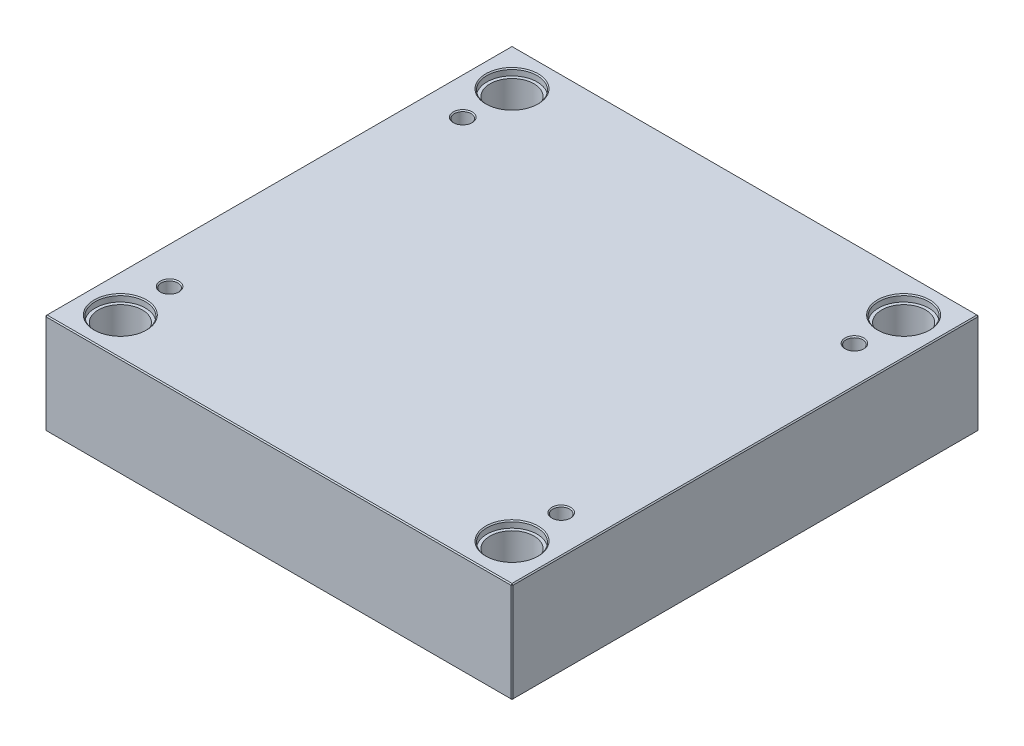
ISO-10303-21;
HEADER;
FILE_DESCRIPTION(('STEP AP214'),'2;1');
FILE_NAME('part.step','',(''),(''),'','','');
FILE_SCHEMA(('AUTOMOTIVE_DESIGN { 1 0 10303 214 1 1 1 1 }'));
ENDSEC;
DATA;
#1=APPLICATION_CONTEXT('core data for automotive mechanical design processes');
#2=APPLICATION_PROTOCOL_DEFINITION('international standard','automotive_design',2000,#1);
#3=PRODUCT_CONTEXT('',#1,'mechanical');
#4=PRODUCT('Part','Part','',(#3));
#5=PRODUCT_RELATED_PRODUCT_CATEGORY('part','',(#4));
#6=PRODUCT_DEFINITION_FORMATION('','',#4);
#7=PRODUCT_DEFINITION_CONTEXT('part definition',#1,'design');
#8=PRODUCT_DEFINITION('design','',#6,#7);
#9=PRODUCT_DEFINITION_SHAPE('','',#8);
#10=(LENGTH_UNIT() NAMED_UNIT(*) SI_UNIT(.MILLI.,.METRE.));
#11=(NAMED_UNIT(*) PLANE_ANGLE_UNIT() SI_UNIT($,.RADIAN.));
#12=(NAMED_UNIT(*) SI_UNIT($,.STERADIAN.) SOLID_ANGLE_UNIT());
#13=UNCERTAINTY_MEASURE_WITH_UNIT(LENGTH_MEASURE(1.E-05),#10,'distance_accuracy_value','');
#14=(GEOMETRIC_REPRESENTATION_CONTEXT(3) GLOBAL_UNCERTAINTY_ASSIGNED_CONTEXT((#13)) GLOBAL_UNIT_ASSIGNED_CONTEXT((#10,
#11,#12)) REPRESENTATION_CONTEXT('',''));
#15=CARTESIAN_POINT('',(0.,0.,0.));
#16=DIRECTION('',(0.,0.,1.));
#17=DIRECTION('',(1.,0.,0.));
#18=AXIS2_PLACEMENT_3D('',#15,#16,#17);
#19=CARTESIAN_POINT('',(-187.,0.,-187.));
#20=DIRECTION('',(0.,1.,0.));
#21=DIRECTION('',(0.,0.,1.));
#22=AXIS2_PLACEMENT_3D('',#19,#20,#21);
#23=CYLINDRICAL_SURFACE('',#22,21.);
#24=CARTESIAN_POINT('',(-187.,1.00000000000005,-187.));
#25=DIRECTION('',(0.,1.,0.));
#26=DIRECTION('',(0.,0.,1.));
#27=AXIS2_PLACEMENT_3D('',#24,#25,#26);
#28=CIRCLE('',#27,21.);
#29=CARTESIAN_POINT('',(-187.,1.00000000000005,-166.));
#30=VERTEX_POINT('',#29);
#31=EDGE_CURVE('E472',#30,#30,#28,.F.);
#32=ORIENTED_EDGE('',*,*,#31,.T.);
#33=EDGE_LOOP('',(#32));
#34=FACE_BOUND('',#33,.T.);
#35=CARTESIAN_POINT('',(-187.,89.7,-187.));
#36=DIRECTION('',(0.,1.,0.));
#37=DIRECTION('',(0.,0.,1.));
#38=AXIS2_PLACEMENT_3D('',#35,#36,#37);
#39=CIRCLE('',#38,21.);
#40=CARTESIAN_POINT('',(-187.,89.7,-166.));
#41=VERTEX_POINT('',#40);
#42=EDGE_CURVE('E221',#41,#41,#39,.F.);
#43=ORIENTED_EDGE('',*,*,#42,.F.);
#44=EDGE_LOOP('',(#43));
#45=FACE_BOUND('',#44,.T.);
#46=ADVANCED_FACE('F16',(#34,#45),#23,.F.);
#47=CARTESIAN_POINT('',(187.,0.,-187.));
#48=DIRECTION('',(0.,1.,0.));
#49=DIRECTION('',(0.,0.,1.));
#50=AXIS2_PLACEMENT_3D('',#47,#48,#49);
#51=CYLINDRICAL_SURFACE('',#50,21.);
#52=CARTESIAN_POINT('',(187.,1.00000000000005,-187.));
#53=DIRECTION('',(0.,1.,0.));
#54=DIRECTION('',(0.,0.,1.));
#55=AXIS2_PLACEMENT_3D('',#52,#53,#54);
#56=CIRCLE('',#55,21.);
#57=CARTESIAN_POINT('',(187.,1.00000000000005,-166.));
#58=VERTEX_POINT('',#57);
#59=EDGE_CURVE('E474',#58,#58,#56,.F.);
#60=ORIENTED_EDGE('',*,*,#59,.T.);
#61=EDGE_LOOP('',(#60));
#62=FACE_BOUND('',#61,.T.);
#63=CARTESIAN_POINT('',(187.,89.7,-187.));
#64=DIRECTION('',(0.,1.,0.));
#65=DIRECTION('',(0.,0.,1.));
#66=AXIS2_PLACEMENT_3D('',#63,#64,#65);
#67=CIRCLE('',#66,21.);
#68=CARTESIAN_POINT('',(187.,89.7,-166.));
#69=VERTEX_POINT('',#68);
#70=EDGE_CURVE('E218',#69,#69,#67,.F.);
#71=ORIENTED_EDGE('',*,*,#70,.F.);
#72=EDGE_LOOP('',(#71));
#73=FACE_BOUND('',#72,.T.);
#74=ADVANCED_FACE('F263',(#62,#73),#51,.F.);
#75=CARTESIAN_POINT('',(187.,0.,187.));
#76=DIRECTION('',(0.,1.,0.));
#77=DIRECTION('',(0.,0.,1.));
#78=AXIS2_PLACEMENT_3D('',#75,#76,#77);
#79=CYLINDRICAL_SURFACE('',#78,21.);
#80=CARTESIAN_POINT('',(187.,0.999999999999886,187.));
#81=DIRECTION('',(0.,1.,0.));
#82=DIRECTION('',(0.,0.,1.));
#83=AXIS2_PLACEMENT_3D('',#80,#81,#82);
#84=CIRCLE('',#83,21.);
#85=CARTESIAN_POINT('',(187.,0.999999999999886,208.));
#86=VERTEX_POINT('',#85);
#87=EDGE_CURVE('E477',#86,#86,#84,.F.);
#88=ORIENTED_EDGE('',*,*,#87,.T.);
#89=EDGE_LOOP('',(#88));
#90=FACE_BOUND('',#89,.T.);
#91=CARTESIAN_POINT('',(187.,89.7,187.));
#92=DIRECTION('',(0.,1.,0.));
#93=DIRECTION('',(0.,0.,1.));
#94=AXIS2_PLACEMENT_3D('',#91,#92,#93);
#95=CIRCLE('',#94,21.);
#96=CARTESIAN_POINT('',(187.,89.7,208.));
#97=VERTEX_POINT('',#96);
#98=EDGE_CURVE('E214',#97,#97,#95,.F.);
#99=ORIENTED_EDGE('',*,*,#98,.F.);
#100=EDGE_LOOP('',(#99));
#101=FACE_BOUND('',#100,.T.);
#102=ADVANCED_FACE('F270',(#90,#101),#79,.F.);
#103=CARTESIAN_POINT('',(-187.,0.,187.));
#104=DIRECTION('',(0.,1.,0.));
#105=DIRECTION('',(0.,0.,1.));
#106=AXIS2_PLACEMENT_3D('',#103,#104,#105);
#107=CYLINDRICAL_SURFACE('',#106,21.);
#108=CARTESIAN_POINT('',(-187.,0.999999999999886,187.));
#109=DIRECTION('',(0.,1.,0.));
#110=DIRECTION('',(0.,0.,1.));
#111=AXIS2_PLACEMENT_3D('',#108,#109,#110);
#112=CIRCLE('',#111,21.);
#113=CARTESIAN_POINT('',(-187.,0.999999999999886,208.));
#114=VERTEX_POINT('',#113);
#115=EDGE_CURVE('E480',#114,#114,#112,.F.);
#116=ORIENTED_EDGE('',*,*,#115,.T.);
#117=EDGE_LOOP('',(#116));
#118=FACE_BOUND('',#117,.T.);
#119=CARTESIAN_POINT('',(-187.,89.7,187.));
#120=DIRECTION('',(0.,1.,0.));
#121=DIRECTION('',(0.,0.,1.));
#122=AXIS2_PLACEMENT_3D('',#119,#120,#121);
#123=CIRCLE('',#122,21.);
#124=CARTESIAN_POINT('',(-187.,89.7,208.));
#125=VERTEX_POINT('',#124);
#126=EDGE_CURVE('E211',#125,#125,#123,.F.);
#127=ORIENTED_EDGE('',*,*,#126,.F.);
#128=EDGE_LOOP('',(#127));
#129=FACE_BOUND('',#128,.T.);
#130=ADVANCED_FACE('F277',(#118,#129),#107,.F.);
#131=CARTESIAN_POINT('',(-223.,96.,223.));
#132=DIRECTION('',(1.,0.,0.));
#133=DIRECTION('',(0.,0.,-1.));
#134=AXIS2_PLACEMENT_3D('',#131,#132,#133);
#135=PLANE('',#134);
#136=DIRECTION('',(0.,-1.,0.));
#137=VECTOR('',#136,1.);
#138=CARTESIAN_POINT('',(-223.,96.,-222.));
#139=LINE('',#138,#137);
#140=CARTESIAN_POINT('',(-223.,95.,-222.));
#141=VERTEX_POINT('',#140);
#142=CARTESIAN_POINT('',(-223.,1.,-222.));
#143=VERTEX_POINT('',#142);
#144=EDGE_CURVE('E487',#141,#143,#139,.T.);
#145=ORIENTED_EDGE('',*,*,#144,.T.);
#146=DIRECTION('',(0.,0.,1.));
#147=VECTOR('',#146,1.);
#148=CARTESIAN_POINT('',(-223.,1.,223.));
#149=LINE('',#148,#147);
#150=CARTESIAN_POINT('',(-223.,1.,222.));
#151=VERTEX_POINT('',#150);
#152=EDGE_CURVE('E490',#143,#151,#149,.T.);
#153=ORIENTED_EDGE('',*,*,#152,.T.);
#154=DIRECTION('',(0.,1.,0.));
#155=VECTOR('',#154,1.);
#156=CARTESIAN_POINT('',(-223.,96.,222.));
#157=LINE('',#156,#155);
#158=CARTESIAN_POINT('',(-223.,95.,222.));
#159=VERTEX_POINT('',#158);
#160=EDGE_CURVE('E485',#151,#159,#157,.T.);
#161=ORIENTED_EDGE('',*,*,#160,.T.);
#162=DIRECTION('',(0.,0.,-1.));
#163=VECTOR('',#162,1.);
#164=CARTESIAN_POINT('',(-223.,95.,-223.));
#165=LINE('',#164,#163);
#166=EDGE_CURVE('E483',#159,#141,#165,.T.);
#167=ORIENTED_EDGE('',*,*,#166,.T.);
#168=EDGE_LOOP('',(#145,#153,#161,#167));
#169=FACE_BOUND('',#168,.T.);
#170=ADVANCED_FACE('F298',(#169),#135,.F.);
#171=CARTESIAN_POINT('',(223.,96.,223.));
#172=DIRECTION('',(0.,0.,-1.));
#173=DIRECTION('',(-1.,0.,0.));
#174=AXIS2_PLACEMENT_3D('',#171,#172,#173);
#175=PLANE('',#174);
#176=DIRECTION('',(-1.,0.,0.));
#177=VECTOR('',#176,1.);
#178=CARTESIAN_POINT('',(-223.,95.,223.));
#179=LINE('',#178,#177);
#180=CARTESIAN_POINT('',(222.,95.,223.));
#181=VERTEX_POINT('',#180);
#182=CARTESIAN_POINT('',(-222.,95.,223.));
#183=VERTEX_POINT('',#182);
#184=EDGE_CURVE('E509',#181,#183,#179,.T.);
#185=ORIENTED_EDGE('',*,*,#184,.T.);
#186=DIRECTION('',(0.,-1.,0.));
#187=VECTOR('',#186,1.);
#188=CARTESIAN_POINT('',(-222.,96.,223.));
#189=LINE('',#188,#187);
#190=CARTESIAN_POINT('',(-222.,1.00000000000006,223.));
#191=VERTEX_POINT('',#190);
#192=EDGE_CURVE('E515',#183,#191,#189,.T.);
#193=ORIENTED_EDGE('',*,*,#192,.T.);
#194=DIRECTION('',(1.,0.,0.));
#195=VECTOR('',#194,1.);
#196=CARTESIAN_POINT('',(223.,1.00000000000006,223.));
#197=LINE('',#196,#195);
#198=CARTESIAN_POINT('',(222.,1.00000000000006,223.));
#199=VERTEX_POINT('',#198);
#200=EDGE_CURVE('E513',#191,#199,#197,.T.);
#201=ORIENTED_EDGE('',*,*,#200,.T.);
#202=DIRECTION('',(0.,1.,0.));
#203=VECTOR('',#202,1.);
#204=CARTESIAN_POINT('',(222.,96.,223.));
#205=LINE('',#204,#203);
#206=EDGE_CURVE('E511',#199,#181,#205,.T.);
#207=ORIENTED_EDGE('',*,*,#206,.T.);
#208=EDGE_LOOP('',(#185,#193,#201,#207));
#209=FACE_BOUND('',#208,.T.);
#210=ADVANCED_FACE('F294',(#209),#175,.F.);
#211=CARTESIAN_POINT('',(223.,96.,223.));
#212=DIRECTION('',(-1.,0.,0.));
#213=DIRECTION('',(0.,0.,1.));
#214=AXIS2_PLACEMENT_3D('',#211,#212,#213);
#215=PLANE('',#214);
#216=DIRECTION('',(0.,0.,-1.));
#217=VECTOR('',#216,1.);
#218=CARTESIAN_POINT('',(223.,1.00000000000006,223.));
#219=LINE('',#218,#217);
#220=CARTESIAN_POINT('',(223.,1.00000000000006,222.));
#221=VERTEX_POINT('',#220);
#222=CARTESIAN_POINT('',(223.,1.00000000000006,-222.));
#223=VERTEX_POINT('',#222);
#224=EDGE_CURVE('E504',#221,#223,#219,.T.);
#225=ORIENTED_EDGE('',*,*,#224,.T.);
#226=DIRECTION('',(0.,1.,0.));
#227=VECTOR('',#226,1.);
#228=CARTESIAN_POINT('',(223.,96.,-222.));
#229=LINE('',#228,#227);
#230=CARTESIAN_POINT('',(223.,95.,-222.));
#231=VERTEX_POINT('',#230);
#232=EDGE_CURVE('E506',#223,#231,#229,.T.);
#233=ORIENTED_EDGE('',*,*,#232,.T.);
#234=DIRECTION('',(0.,0.,1.));
#235=VECTOR('',#234,1.);
#236=CARTESIAN_POINT('',(223.,95.,223.));
#237=LINE('',#236,#235);
#238=CARTESIAN_POINT('',(223.,95.,222.));
#239=VERTEX_POINT('',#238);
#240=EDGE_CURVE('E500',#231,#239,#237,.T.);
#241=ORIENTED_EDGE('',*,*,#240,.T.);
#242=DIRECTION('',(0.,-1.,0.));
#243=VECTOR('',#242,1.);
#244=CARTESIAN_POINT('',(223.,96.,222.));
#245=LINE('',#244,#243);
#246=EDGE_CURVE('E502',#239,#221,#245,.T.);
#247=ORIENTED_EDGE('',*,*,#246,.T.);
#248=EDGE_LOOP('',(#225,#233,#241,#247));
#249=FACE_BOUND('',#248,.T.);
#250=ADVANCED_FACE('F290',(#249),#215,.F.);
#251=CARTESIAN_POINT('',(223.,96.,-223.));
#252=DIRECTION('',(0.,0.,1.));
#253=DIRECTION('',(1.,0.,0.));
#254=AXIS2_PLACEMENT_3D('',#251,#252,#253);
#255=PLANE('',#254);
#256=DIRECTION('',(0.,-1.,0.));
#257=VECTOR('',#256,1.);
#258=CARTESIAN_POINT('',(222.,96.,-223.));
#259=LINE('',#258,#257);
#260=CARTESIAN_POINT('',(222.,95.,-223.));
#261=VERTEX_POINT('',#260);
#262=CARTESIAN_POINT('',(222.,1.00000000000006,-223.));
#263=VERTEX_POINT('',#262);
#264=EDGE_CURVE('E494',#261,#263,#259,.T.);
#265=ORIENTED_EDGE('',*,*,#264,.T.);
#266=DIRECTION('',(-1.,0.,0.));
#267=VECTOR('',#266,1.);
#268=CARTESIAN_POINT('',(223.,1.00000000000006,-223.));
#269=LINE('',#268,#267);
#270=CARTESIAN_POINT('',(-222.,1.00000000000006,-223.));
#271=VERTEX_POINT('',#270);
#272=EDGE_CURVE('E138',#263,#271,#269,.T.);
#273=ORIENTED_EDGE('',*,*,#272,.T.);
#274=DIRECTION('',(0.,1.,0.));
#275=VECTOR('',#274,1.);
#276=CARTESIAN_POINT('',(-222.,96.,-223.));
#277=LINE('',#276,#275);
#278=CARTESIAN_POINT('',(-222.,95.,-223.));
#279=VERTEX_POINT('',#278);
#280=EDGE_CURVE('E496',#271,#279,#277,.T.);
#281=ORIENTED_EDGE('',*,*,#280,.T.);
#282=DIRECTION('',(1.,0.,0.));
#283=VECTOR('',#282,1.);
#284=CARTESIAN_POINT('',(223.,95.,-223.));
#285=LINE('',#284,#283);
#286=EDGE_CURVE('E492',#279,#261,#285,.T.);
#287=ORIENTED_EDGE('',*,*,#286,.T.);
#288=EDGE_LOOP('',(#265,#273,#281,#287));
#289=FACE_BOUND('',#288,.T.);
#290=ADVANCED_FACE('F282',(#289),#255,.F.);
#291=CARTESIAN_POINT('',(0.,96.,0.));
#292=DIRECTION('',(0.,1.,0.));
#293=DIRECTION('',(0.,0.,1.));
#294=AXIS2_PLACEMENT_3D('',#291,#292,#293);
#295=PLANE('',#294);
#296=CARTESIAN_POINT('',(187.,96.,187.));
#297=DIRECTION('',(0.,1.,0.));
#298=DIRECTION('',(0.,0.,1.));
#299=AXIS2_PLACEMENT_3D('',#296,#297,#298);
#300=CIRCLE('',#299,25.);
#301=CARTESIAN_POINT('',(187.,96.,212.));
#302=VERTEX_POINT('',#301);
#303=EDGE_CURVE('E236',#302,#302,#300,.F.);
#304=ORIENTED_EDGE('',*,*,#303,.T.);
#305=EDGE_LOOP('',(#304));
#306=FACE_BOUND('',#305,.T.);
#307=CARTESIAN_POINT('',(-187.,96.,187.));
#308=DIRECTION('',(0.,1.,0.));
#309=DIRECTION('',(0.,0.,1.));
#310=AXIS2_PLACEMENT_3D('',#307,#308,#309);
#311=CIRCLE('',#310,25.);
#312=CARTESIAN_POINT('',(-187.,96.,212.));
#313=VERTEX_POINT('',#312);
#314=EDGE_CURVE('E233',#313,#313,#311,.F.);
#315=ORIENTED_EDGE('',*,*,#314,.T.);
#316=EDGE_LOOP('',(#315));
#317=FACE_BOUND('',#316,.T.);
#318=CARTESIAN_POINT('',(187.,96.,-187.));
#319=DIRECTION('',(0.,1.,0.));
#320=DIRECTION('',(0.,0.,1.));
#321=AXIS2_PLACEMENT_3D('',#318,#319,#320);
#322=CIRCLE('',#321,25.);
#323=CARTESIAN_POINT('',(187.,96.,-162.));
#324=VERTEX_POINT('',#323);
#325=EDGE_CURVE('E230',#324,#324,#322,.F.);
#326=ORIENTED_EDGE('',*,*,#325,.T.);
#327=EDGE_LOOP('',(#326));
#328=FACE_BOUND('',#327,.T.);
#329=CARTESIAN_POINT('',(-187.,96.,-187.));
#330=DIRECTION('',(0.,1.,0.));
#331=DIRECTION('',(0.,0.,1.));
#332=AXIS2_PLACEMENT_3D('',#329,#330,#331);
#333=CIRCLE('',#332,25.);
#334=CARTESIAN_POINT('',(-187.,96.,-162.));
#335=VERTEX_POINT('',#334);
#336=EDGE_CURVE('E227',#335,#335,#333,.F.);
#337=ORIENTED_EDGE('',*,*,#336,.T.);
#338=EDGE_LOOP('',(#337));
#339=FACE_BOUND('',#338,.T.);
#340=CARTESIAN_POINT('',(-187.,96.,140.));
#341=DIRECTION('',(0.,1.,0.));
#342=DIRECTION('',(0.,0.,1.));
#343=AXIS2_PLACEMENT_3D('',#340,#341,#342);
#344=CIRCLE('',#343,9.);
#345=CARTESIAN_POINT('',(-187.,96.,149.));
#346=VERTEX_POINT('',#345);
#347=EDGE_CURVE('E198',#346,#346,#344,.F.);
#348=ORIENTED_EDGE('',*,*,#347,.T.);
#349=EDGE_LOOP('',(#348));
#350=FACE_BOUND('',#349,.T.);
#351=CARTESIAN_POINT('',(187.,96.,140.));
#352=DIRECTION('',(0.,1.,0.));
#353=DIRECTION('',(0.,0.,1.));
#354=AXIS2_PLACEMENT_3D('',#351,#352,#353);
#355=CIRCLE('',#354,9.);
#356=CARTESIAN_POINT('',(187.,96.,149.));
#357=VERTEX_POINT('',#356);
#358=EDGE_CURVE('E195',#357,#357,#355,.F.);
#359=ORIENTED_EDGE('',*,*,#358,.T.);
#360=EDGE_LOOP('',(#359));
#361=FACE_BOUND('',#360,.T.);
#362=CARTESIAN_POINT('',(187.,96.,-140.));
#363=DIRECTION('',(0.,1.,0.));
#364=DIRECTION('',(0.,0.,1.));
#365=AXIS2_PLACEMENT_3D('',#362,#363,#364);
#366=CIRCLE('',#365,8.9999999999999);
#367=CARTESIAN_POINT('',(187.,96.,-131.));
#368=VERTEX_POINT('',#367);
#369=EDGE_CURVE('E192',#368,#368,#366,.F.);
#370=ORIENTED_EDGE('',*,*,#369,.T.);
#371=EDGE_LOOP('',(#370));
#372=FACE_BOUND('',#371,.T.);
#373=CARTESIAN_POINT('',(-187.,96.,-140.));
#374=DIRECTION('',(0.,1.,0.));
#375=DIRECTION('',(0.,0.,1.));
#376=AXIS2_PLACEMENT_3D('',#373,#374,#375);
#377=CIRCLE('',#376,9.);
#378=CARTESIAN_POINT('',(-187.,96.,-131.));
#379=VERTEX_POINT('',#378);
#380=EDGE_CURVE('E188',#379,#379,#377,.F.);
#381=ORIENTED_EDGE('',*,*,#380,.T.);
#382=EDGE_LOOP('',(#381));
#383=FACE_BOUND('',#382,.T.);
#384=DIRECTION('',(0.,0.,-1.));
#385=VECTOR('',#384,1.);
#386=CARTESIAN_POINT('',(222.,96.,-223.));
#387=LINE('',#386,#385);
#388=CARTESIAN_POINT('',(222.,96.,222.));
#389=VERTEX_POINT('',#388);
#390=CARTESIAN_POINT('',(222.,96.,-222.));
#391=VERTEX_POINT('',#390);
#392=EDGE_CURVE('E31',#389,#391,#387,.T.);
#393=ORIENTED_EDGE('',*,*,#392,.T.);
#394=DIRECTION('',(-1.,0.,0.));
#395=VECTOR('',#394,1.);
#396=CARTESIAN_POINT('',(-223.,96.,-222.));
#397=LINE('',#396,#395);
#398=CARTESIAN_POINT('',(-222.,96.,-222.));
#399=VERTEX_POINT('',#398);
#400=EDGE_CURVE('E189',#391,#399,#397,.T.);
#401=ORIENTED_EDGE('',*,*,#400,.T.);
#402=DIRECTION('',(0.,0.,1.));
#403=VECTOR('',#402,1.);
#404=CARTESIAN_POINT('',(-222.,96.,223.));
#405=LINE('',#404,#403);
#406=CARTESIAN_POINT('',(-222.,96.,222.));
#407=VERTEX_POINT('',#406);
#408=EDGE_CURVE('E518',#399,#407,#405,.T.);
#409=ORIENTED_EDGE('',*,*,#408,.T.);
#410=DIRECTION('',(1.,0.,0.));
#411=VECTOR('',#410,1.);
#412=CARTESIAN_POINT('',(223.,96.,222.));
#413=LINE('',#412,#411);
#414=EDGE_CURVE('E36',#407,#389,#413,.T.);
#415=ORIENTED_EDGE('',*,*,#414,.T.);
#416=EDGE_LOOP('',(#393,#401,#409,#415));
#417=FACE_BOUND('',#416,.T.);
#418=ADVANCED_FACE('F279',(#306,#317,#328,#339,#350,#361,#372,#383,#417),#295,.T.);
#419=CARTESIAN_POINT('',(0.,0.,0.));
#420=DIRECTION('',(0.,1.,0.));
#421=DIRECTION('',(0.,0.,1.));
#422=AXIS2_PLACEMENT_3D('',#419,#420,#421);
#423=PLANE('',#422);
#424=CARTESIAN_POINT('',(-187.,0.,-187.));
#425=DIRECTION('',(0.,1.,0.));
#426=DIRECTION('',(0.,0.,1.));
#427=AXIS2_PLACEMENT_3D('',#424,#425,#426);
#428=CIRCLE('',#427,22.);
#429=CARTESIAN_POINT('',(-187.,0.,-165.));
#430=VERTEX_POINT('',#429);
#431=EDGE_CURVE('E469',#430,#430,#428,.T.);
#432=ORIENTED_EDGE('',*,*,#431,.T.);
#433=EDGE_LOOP('',(#432));
#434=FACE_BOUND('',#433,.T.);
#435=CARTESIAN_POINT('',(187.,0.,-187.));
#436=DIRECTION('',(0.,1.,0.));
#437=DIRECTION('',(0.,0.,1.));
#438=AXIS2_PLACEMENT_3D('',#435,#436,#437);
#439=CIRCLE('',#438,22.);
#440=CARTESIAN_POINT('',(187.,0.,-165.));
#441=VERTEX_POINT('',#440);
#442=EDGE_CURVE('E466',#441,#441,#439,.T.);
#443=ORIENTED_EDGE('',*,*,#442,.T.);
#444=EDGE_LOOP('',(#443));
#445=FACE_BOUND('',#444,.T.);
#446=CARTESIAN_POINT('',(187.,0.,187.));
#447=DIRECTION('',(0.,1.,0.));
#448=DIRECTION('',(0.,0.,1.));
#449=AXIS2_PLACEMENT_3D('',#446,#447,#448);
#450=CIRCLE('',#449,22.);
#451=CARTESIAN_POINT('',(187.,0.,209.));
#452=VERTEX_POINT('',#451);
#453=EDGE_CURVE('E463',#452,#452,#450,.T.);
#454=ORIENTED_EDGE('',*,*,#453,.T.);
#455=EDGE_LOOP('',(#454));
#456=FACE_BOUND('',#455,.T.);
#457=CARTESIAN_POINT('',(-187.,0.,187.));
#458=DIRECTION('',(0.,1.,0.));
#459=DIRECTION('',(0.,0.,1.));
#460=AXIS2_PLACEMENT_3D('',#457,#458,#459);
#461=CIRCLE('',#460,22.);
#462=CARTESIAN_POINT('',(-187.,0.,209.));
#463=VERTEX_POINT('',#462);
#464=EDGE_CURVE('E460',#463,#463,#461,.T.);
#465=ORIENTED_EDGE('',*,*,#464,.T.);
#466=EDGE_LOOP('',(#465));
#467=FACE_BOUND('',#466,.T.);
#468=DIRECTION('',(0.,0.,1.));
#469=VECTOR('',#468,1.);
#470=CARTESIAN_POINT('',(222.,0.,0.));
#471=LINE('',#470,#469);
#472=CARTESIAN_POINT('',(222.,0.,-222.));
#473=VERTEX_POINT('',#472);
#474=CARTESIAN_POINT('',(222.,0.,222.));
#475=VERTEX_POINT('',#474);
#476=EDGE_CURVE('E108',#473,#475,#471,.T.);
#477=ORIENTED_EDGE('',*,*,#476,.T.);
#478=DIRECTION('',(-1.,0.,0.));
#479=VECTOR('',#478,1.);
#480=CARTESIAN_POINT('',(0.,0.,222.));
#481=LINE('',#480,#479);
#482=CARTESIAN_POINT('',(-222.,0.,222.));
#483=VERTEX_POINT('',#482);
#484=EDGE_CURVE('E458',#475,#483,#481,.T.);
#485=ORIENTED_EDGE('',*,*,#484,.T.);
#486=DIRECTION('',(0.,0.,-1.));
#487=VECTOR('',#486,1.);
#488=CARTESIAN_POINT('',(-222.,0.,0.));
#489=LINE('',#488,#487);
#490=CARTESIAN_POINT('',(-222.,0.,-222.));
#491=VERTEX_POINT('',#490);
#492=EDGE_CURVE('E110',#483,#491,#489,.T.);
#493=ORIENTED_EDGE('',*,*,#492,.T.);
#494=DIRECTION('',(1.,0.,0.));
#495=VECTOR('',#494,1.);
#496=CARTESIAN_POINT('',(0.,0.,-222.));
#497=LINE('',#496,#495);
#498=EDGE_CURVE('E104',#491,#473,#497,.T.);
#499=ORIENTED_EDGE('',*,*,#498,.T.);
#500=EDGE_LOOP('',(#477,#485,#493,#499));
#501=FACE_BOUND('',#500,.T.);
#502=ADVANCED_FACE('F106',(#434,#445,#456,#467,#501),#423,.F.);
#503=CARTESIAN_POINT('',(-187.,0.,-187.));
#504=DIRECTION('',(0.,-1.,0.));
#505=DIRECTION('',(0.,0.,-1.));
#506=AXIS2_PLACEMENT_3D('',#503,#504,#505);
#507=CONICAL_SURFACE('',#506,22.,0.785398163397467);
#508=ORIENTED_EDGE('',*,*,#31,.F.);
#509=EDGE_LOOP('',(#508));
#510=FACE_BOUND('',#509,.T.);
#511=ORIENTED_EDGE('',*,*,#431,.F.);
#512=EDGE_LOOP('',(#511));
#513=FACE_BOUND('',#512,.T.);
#514=ADVANCED_FACE('F286',(#510,#513),#507,.F.);
#515=CARTESIAN_POINT('',(187.,0.,-187.));
#516=DIRECTION('',(0.,-1.,0.));
#517=DIRECTION('',(0.,0.,-1.));
#518=AXIS2_PLACEMENT_3D('',#515,#516,#517);
#519=CONICAL_SURFACE('',#518,22.,0.785398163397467);
#520=ORIENTED_EDGE('',*,*,#59,.F.);
#521=EDGE_LOOP('',(#520));
#522=FACE_BOUND('',#521,.T.);
#523=ORIENTED_EDGE('',*,*,#442,.F.);
#524=EDGE_LOOP('',(#523));
#525=FACE_BOUND('',#524,.T.);
#526=ADVANCED_FACE('F305',(#522,#525),#519,.F.);
#527=CARTESIAN_POINT('',(187.,0.,187.));
#528=DIRECTION('',(0.,-1.,0.));
#529=DIRECTION('',(0.,0.,-1.));
#530=AXIS2_PLACEMENT_3D('',#527,#528,#529);
#531=CONICAL_SURFACE('',#530,22.,0.785398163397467);
#532=ORIENTED_EDGE('',*,*,#87,.F.);
#533=EDGE_LOOP('',(#532));
#534=FACE_BOUND('',#533,.T.);
#535=ORIENTED_EDGE('',*,*,#453,.F.);
#536=EDGE_LOOP('',(#535));
#537=FACE_BOUND('',#536,.T.);
#538=ADVANCED_FACE('F309',(#534,#537),#531,.F.);
#539=CARTESIAN_POINT('',(-187.,0.,187.));
#540=DIRECTION('',(0.,-1.,0.));
#541=DIRECTION('',(0.,0.,-1.));
#542=AXIS2_PLACEMENT_3D('',#539,#540,#541);
#543=CONICAL_SURFACE('',#542,22.,0.785398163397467);
#544=ORIENTED_EDGE('',*,*,#115,.F.);
#545=EDGE_LOOP('',(#544));
#546=FACE_BOUND('',#545,.T.);
#547=ORIENTED_EDGE('',*,*,#464,.F.);
#548=EDGE_LOOP('',(#547));
#549=FACE_BOUND('',#548,.T.);
#550=ADVANCED_FACE('F313',(#546,#549),#543,.F.);
#551=CARTESIAN_POINT('',(223.,96.,222.));
#552=DIRECTION('',(-0.707106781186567,0.,-0.707106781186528));
#553=DIRECTION('',(0.,-1.,0.));
#554=AXIS2_PLACEMENT_3D('',#551,#552,#553);
#555=PLANE('',#554);
#556=DIRECTION('',(-0.707106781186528,0.,0.707106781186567));
#557=VECTOR('',#556,1.);
#558=CARTESIAN_POINT('',(222.,95.,223.));
#559=LINE('',#558,#557);
#560=EDGE_CURVE('E126',#181,#239,#559,.F.);
#561=ORIENTED_EDGE('',*,*,#560,.F.);
#562=ORIENTED_EDGE('',*,*,#206,.F.);
#563=DIRECTION('',(0.707106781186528,0.,-0.707106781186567));
#564=VECTOR('',#563,1.);
#565=CARTESIAN_POINT('',(222.,1.00000000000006,223.));
#566=LINE('',#565,#564);
#567=EDGE_CURVE('E180',#221,#199,#566,.F.);
#568=ORIENTED_EDGE('',*,*,#567,.F.);
#569=ORIENTED_EDGE('',*,*,#246,.F.);
#570=EDGE_LOOP('',(#561,#562,#568,#569));
#571=FACE_BOUND('',#570,.T.);
#572=ADVANCED_FACE('F317',(#571),#555,.F.);
#573=CARTESIAN_POINT('',(222.,95.,223.));
#574=DIRECTION('',(0.577350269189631,0.577350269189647,0.577350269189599));
#575=DIRECTION('',(-0.707106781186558,0.707106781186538,0.));
#576=AXIS2_PLACEMENT_3D('',#573,#574,#575);
#577=PLANE('',#576);
#578=DIRECTION('',(0.,-0.707106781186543,0.707106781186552));
#579=VECTOR('',#578,1.);
#580=CARTESIAN_POINT('',(222.,95.,223.));
#581=LINE('',#580,#579);
#582=EDGE_CURVE('E175',#181,#389,#581,.F.);
#583=ORIENTED_EDGE('',*,*,#582,.F.);
#584=ORIENTED_EDGE('',*,*,#560,.T.);
#585=DIRECTION('',(-0.707106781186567,0.707106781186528,0.));
#586=VECTOR('',#585,1.);
#587=CARTESIAN_POINT('',(222.5,95.5,222.));
#588=LINE('',#587,#586);
#589=EDGE_CURVE('E177',#389,#239,#588,.F.);
#590=ORIENTED_EDGE('',*,*,#589,.F.);
#591=EDGE_LOOP('',(#583,#584,#590));
#592=FACE_BOUND('',#591,.T.);
#593=ADVANCED_FACE('F385',(#592),#577,.T.);
#594=CARTESIAN_POINT('',(222.,1.00000000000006,223.));
#595=DIRECTION('',(0.577350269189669,-0.577350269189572,0.577350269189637));
#596=DIRECTION('',(0.707106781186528,0.,-0.707106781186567));
#597=AXIS2_PLACEMENT_3D('',#594,#595,#596);
#598=PLANE('',#597);
#599=DIRECTION('',(-0.707106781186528,-0.707106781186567,0.));
#600=VECTOR('',#599,1.);
#601=CARTESIAN_POINT('',(222.5,0.5,222.));
#602=LINE('',#601,#600);
#603=EDGE_CURVE('E124',#221,#475,#602,.T.);
#604=ORIENTED_EDGE('',*,*,#603,.F.);
#605=ORIENTED_EDGE('',*,*,#567,.T.);
#606=DIRECTION('',(0.,0.707106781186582,0.707106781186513));
#607=VECTOR('',#606,1.);
#608=CARTESIAN_POINT('',(222.,1.00000000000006,223.));
#609=LINE('',#608,#607);
#610=EDGE_CURVE('E172',#475,#199,#609,.T.);
#611=ORIENTED_EDGE('',*,*,#610,.F.);
#612=EDGE_LOOP('',(#604,#605,#611));
#613=FACE_BOUND('',#612,.T.);
#614=ADVANCED_FACE('F381',(#613),#598,.T.);
#615=CARTESIAN_POINT('',(222.,96.,0.));
#616=DIRECTION('',(0.707106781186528,0.707106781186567,0.));
#617=DIRECTION('',(0.,0.,1.));
#618=AXIS2_PLACEMENT_3D('',#615,#616,#617);
#619=PLANE('',#618);
#620=ORIENTED_EDGE('',*,*,#589,.T.);
#621=ORIENTED_EDGE('',*,*,#240,.F.);
#622=DIRECTION('',(0.707106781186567,-0.707106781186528,0.));
#623=VECTOR('',#622,1.);
#624=CARTESIAN_POINT('',(223.,95.,-222.));
#625=LINE('',#624,#623);
#626=EDGE_CURVE('E166',#391,#231,#625,.T.);
#627=ORIENTED_EDGE('',*,*,#626,.F.);
#628=ORIENTED_EDGE('',*,*,#392,.F.);
#629=EDGE_LOOP('',(#620,#621,#627,#628));
#630=FACE_BOUND('',#629,.T.);
#631=ADVANCED_FACE('F377',(#630),#619,.T.);
#632=CARTESIAN_POINT('',(0.,96.,222.));
#633=DIRECTION('',(0.,0.707106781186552,0.707106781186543));
#634=DIRECTION('',(-1.,0.,0.));
#635=AXIS2_PLACEMENT_3D('',#632,#633,#634);
#636=PLANE('',#635);
#637=ORIENTED_EDGE('',*,*,#582,.T.);
#638=ORIENTED_EDGE('',*,*,#414,.F.);
#639=DIRECTION('',(0.,0.707106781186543,-0.707106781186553));
#640=VECTOR('',#639,1.);
#641=CARTESIAN_POINT('',(-222.,95.5,222.5));
#642=LINE('',#641,#640);
#643=EDGE_CURVE('E163',#183,#407,#642,.T.);
#644=ORIENTED_EDGE('',*,*,#643,.F.);
#645=ORIENTED_EDGE('',*,*,#184,.F.);
#646=EDGE_LOOP('',(#637,#638,#644,#645));
#647=FACE_BOUND('',#646,.T.);
#648=ADVANCED_FACE('F373',(#647),#636,.T.);
#649=CARTESIAN_POINT('',(-222.,96.,223.));
#650=DIRECTION('',(0.707106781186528,0.,-0.707106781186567));
#651=DIRECTION('',(0.,-1.,0.));
#652=AXIS2_PLACEMENT_3D('',#649,#650,#651);
#653=PLANE('',#652);
#654=DIRECTION('',(0.707106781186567,0.,0.707106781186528));
#655=VECTOR('',#654,1.);
#656=CARTESIAN_POINT('',(-222.,1.00000000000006,223.));
#657=LINE('',#656,#655);
#658=EDGE_CURVE('E157',#191,#151,#657,.F.);
#659=ORIENTED_EDGE('',*,*,#658,.F.);
#660=ORIENTED_EDGE('',*,*,#192,.F.);
#661=DIRECTION('',(-0.707106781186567,0.,-0.707106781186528));
#662=VECTOR('',#661,1.);
#663=CARTESIAN_POINT('',(-223.,95.,222.));
#664=LINE('',#663,#662);
#665=EDGE_CURVE('E160',#159,#183,#664,.F.);
#666=ORIENTED_EDGE('',*,*,#665,.F.);
#667=ORIENTED_EDGE('',*,*,#160,.F.);
#668=EDGE_LOOP('',(#659,#660,#666,#667));
#669=FACE_BOUND('',#668,.T.);
#670=ADVANCED_FACE('F369',(#669),#653,.F.);
#671=CARTESIAN_POINT('',(223.,1.00000000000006,223.));
#672=DIRECTION('',(0.,0.707106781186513,-0.707106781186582));
#673=DIRECTION('',(1.,0.,0.));
#674=AXIS2_PLACEMENT_3D('',#671,#672,#673);
#675=PLANE('',#674);
#676=ORIENTED_EDGE('',*,*,#610,.T.);
#677=ORIENTED_EDGE('',*,*,#200,.F.);
#678=DIRECTION('',(0.,-0.707106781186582,-0.707106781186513));
#679=VECTOR('',#678,1.);
#680=CARTESIAN_POINT('',(-222.,1.00000000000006,223.));
#681=LINE('',#680,#679);
#682=EDGE_CURVE('E135',#483,#191,#681,.F.);
#683=ORIENTED_EDGE('',*,*,#682,.F.);
#684=ORIENTED_EDGE('',*,*,#484,.F.);
#685=EDGE_LOOP('',(#676,#677,#683,#684));
#686=FACE_BOUND('',#685,.T.);
#687=ADVANCED_FACE('F366',(#686),#675,.F.);
#688=CARTESIAN_POINT('',(223.,1.00000000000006,223.));
#689=DIRECTION('',(-0.707106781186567,0.707106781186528,0.));
#690=DIRECTION('',(0.,0.,-1.));
#691=AXIS2_PLACEMENT_3D('',#688,#689,#690);
#692=PLANE('',#691);
#693=ORIENTED_EDGE('',*,*,#603,.T.);
#694=ORIENTED_EDGE('',*,*,#476,.F.);
#695=DIRECTION('',(0.707106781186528,0.707106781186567,0.));
#696=VECTOR('',#695,1.);
#697=CARTESIAN_POINT('',(222.5,0.500000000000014,-222.));
#698=LINE('',#697,#696);
#699=EDGE_CURVE('E121',#223,#473,#698,.F.);
#700=ORIENTED_EDGE('',*,*,#699,.F.);
#701=ORIENTED_EDGE('',*,*,#224,.F.);
#702=EDGE_LOOP('',(#693,#694,#700,#701));
#703=FACE_BOUND('',#702,.T.);
#704=ADVANCED_FACE('F119',(#703),#692,.F.);
#705=CARTESIAN_POINT('',(222.,96.,-223.));
#706=DIRECTION('',(-0.707106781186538,0.,0.707106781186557));
#707=DIRECTION('',(0.,-1.,0.));
#708=AXIS2_PLACEMENT_3D('',#705,#706,#707);
#709=PLANE('',#708);
#710=DIRECTION('',(0.707106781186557,0.,0.707106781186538));
#711=VECTOR('',#710,1.);
#712=CARTESIAN_POINT('',(223.,95.,-222.));
#713=LINE('',#712,#711);
#714=EDGE_CURVE('E168',#231,#261,#713,.F.);
#715=ORIENTED_EDGE('',*,*,#714,.F.);
#716=ORIENTED_EDGE('',*,*,#232,.F.);
#717=DIRECTION('',(-0.707106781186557,0.,-0.707106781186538));
#718=VECTOR('',#717,1.);
#719=CARTESIAN_POINT('',(222.,1.00000000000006,-223.));
#720=LINE('',#719,#718);
#721=EDGE_CURVE('E134',#263,#223,#720,.F.);
#722=ORIENTED_EDGE('',*,*,#721,.F.);
#723=ORIENTED_EDGE('',*,*,#264,.F.);
#724=EDGE_LOOP('',(#715,#716,#722,#723));
#725=FACE_BOUND('',#724,.T.);
#726=ADVANCED_FACE('F359',(#725),#709,.F.);
#727=CARTESIAN_POINT('',(223.,95.,-222.));
#728=DIRECTION('',(0.577350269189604,0.577350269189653,-0.57735026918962));
#729=DIRECTION('',(0.,0.707106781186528,0.707106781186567));
#730=AXIS2_PLACEMENT_3D('',#727,#728,#729);
#731=PLANE('',#730);
#732=ORIENTED_EDGE('',*,*,#626,.T.);
#733=ORIENTED_EDGE('',*,*,#714,.T.);
#734=DIRECTION('',(0.,0.707106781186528,0.707106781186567));
#735=VECTOR('',#734,1.);
#736=CARTESIAN_POINT('',(222.,95.5,-222.5));
#737=LINE('',#736,#735);
#738=EDGE_CURVE('E152',#391,#261,#737,.F.);
#739=ORIENTED_EDGE('',*,*,#738,.F.);
#740=EDGE_LOOP('',(#732,#733,#739));
#741=FACE_BOUND('',#740,.T.);
#742=ADVANCED_FACE('F355',(#741),#731,.T.);
#743=CARTESIAN_POINT('',(-223.,95.,222.));
#744=DIRECTION('',(-0.577350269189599,0.577350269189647,0.577350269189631));
#745=DIRECTION('',(0.,-0.707106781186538,0.707106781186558));
#746=AXIS2_PLACEMENT_3D('',#743,#744,#745);
#747=PLANE('',#746);
#748=ORIENTED_EDGE('',*,*,#665,.T.);
#749=ORIENTED_EDGE('',*,*,#643,.T.);
#750=DIRECTION('',(-0.707106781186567,-0.707106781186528,0.));
#751=VECTOR('',#750,1.);
#752=CARTESIAN_POINT('',(-223.,95.,222.));
#753=LINE('',#752,#751);
#754=EDGE_CURVE('E143',#159,#407,#753,.F.);
#755=ORIENTED_EDGE('',*,*,#754,.F.);
#756=EDGE_LOOP('',(#748,#749,#755));
#757=FACE_BOUND('',#756,.T.);
#758=ADVANCED_FACE('F351',(#757),#747,.T.);
#759=CARTESIAN_POINT('',(-222.,1.00000000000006,223.));
#760=DIRECTION('',(-0.577350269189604,-0.577350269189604,0.577350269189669));
#761=DIRECTION('',(0.707106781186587,0.,0.707106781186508));
#762=AXIS2_PLACEMENT_3D('',#759,#760,#761);
#763=PLANE('',#762);
#764=ORIENTED_EDGE('',*,*,#682,.T.);
#765=ORIENTED_EDGE('',*,*,#658,.T.);
#766=DIRECTION('',(-0.707106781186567,0.707106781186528,0.));
#767=VECTOR('',#766,1.);
#768=CARTESIAN_POINT('',(-222.5,0.499999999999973,222.));
#769=LINE('',#768,#767);
#770=EDGE_CURVE('E139',#483,#151,#769,.T.);
#771=ORIENTED_EDGE('',*,*,#770,.F.);
#772=EDGE_LOOP('',(#764,#765,#771));
#773=FACE_BOUND('',#772,.T.);
#774=ADVANCED_FACE('F348',(#773),#763,.T.);
#775=CARTESIAN_POINT('',(222.,1.00000000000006,-223.));
#776=DIRECTION('',(0.577350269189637,-0.577350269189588,-0.577350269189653));
#777=DIRECTION('',(-0.707106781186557,0.,-0.707106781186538));
#778=AXIS2_PLACEMENT_3D('',#775,#776,#777);
#779=PLANE('',#778);
#780=ORIENTED_EDGE('',*,*,#721,.T.);
#781=ORIENTED_EDGE('',*,*,#699,.T.);
#782=DIRECTION('',(0.,-0.707106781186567,0.707106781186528));
#783=VECTOR('',#782,1.);
#784=CARTESIAN_POINT('',(222.,1.00000000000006,-223.));
#785=LINE('',#784,#783);
#786=EDGE_CURVE('E131',#263,#473,#785,.T.);
#787=ORIENTED_EDGE('',*,*,#786,.F.);
#788=EDGE_LOOP('',(#780,#781,#787));
#789=FACE_BOUND('',#788,.T.);
#790=ADVANCED_FACE('F130',(#789),#779,.T.);
#791=CARTESIAN_POINT('',(0.,96.,-222.));
#792=DIRECTION('',(0.,0.707106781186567,-0.707106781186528));
#793=DIRECTION('',(1.,0.,0.));
#794=AXIS2_PLACEMENT_3D('',#791,#792,#793);
#795=PLANE('',#794);
#796=ORIENTED_EDGE('',*,*,#738,.T.);
#797=ORIENTED_EDGE('',*,*,#286,.F.);
#798=DIRECTION('',(0.,-0.707106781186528,-0.707106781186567));
#799=VECTOR('',#798,1.);
#800=CARTESIAN_POINT('',(-222.,95.,-223.));
#801=LINE('',#800,#799);
#802=EDGE_CURVE('E140',#399,#279,#801,.T.);
#803=ORIENTED_EDGE('',*,*,#802,.F.);
#804=ORIENTED_EDGE('',*,*,#400,.F.);
#805=EDGE_LOOP('',(#796,#797,#803,#804));
#806=FACE_BOUND('',#805,.T.);
#807=ADVANCED_FACE('F341',(#806),#795,.T.);
#808=CARTESIAN_POINT('',(-222.,96.,0.));
#809=DIRECTION('',(-0.707106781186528,0.707106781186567,0.));
#810=DIRECTION('',(0.,0.,-1.));
#811=AXIS2_PLACEMENT_3D('',#808,#809,#810);
#812=PLANE('',#811);
#813=ORIENTED_EDGE('',*,*,#754,.T.);
#814=ORIENTED_EDGE('',*,*,#408,.F.);
#815=DIRECTION('',(0.707106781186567,0.707106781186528,0.));
#816=VECTOR('',#815,1.);
#817=CARTESIAN_POINT('',(-222.5,95.5,-222.));
#818=LINE('',#817,#816);
#819=EDGE_CURVE('E146',#141,#399,#818,.T.);
#820=ORIENTED_EDGE('',*,*,#819,.F.);
#821=ORIENTED_EDGE('',*,*,#166,.F.);
#822=EDGE_LOOP('',(#813,#814,#820,#821));
#823=FACE_BOUND('',#822,.T.);
#824=ADVANCED_FACE('F337',(#823),#812,.T.);
#825=CARTESIAN_POINT('',(-223.,1.,223.));
#826=DIRECTION('',(0.707106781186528,0.707106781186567,0.));
#827=DIRECTION('',(0.,0.,1.));
#828=AXIS2_PLACEMENT_3D('',#825,#826,#827);
#829=PLANE('',#828);
#830=ORIENTED_EDGE('',*,*,#770,.T.);
#831=ORIENTED_EDGE('',*,*,#152,.F.);
#832=DIRECTION('',(0.707106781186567,-0.707106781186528,0.));
#833=VECTOR('',#832,1.);
#834=CARTESIAN_POINT('',(-223.,1.,-222.));
#835=LINE('',#834,#833);
#836=EDGE_CURVE('E529',#491,#143,#835,.F.);
#837=ORIENTED_EDGE('',*,*,#836,.F.);
#838=ORIENTED_EDGE('',*,*,#492,.F.);
#839=EDGE_LOOP('',(#830,#831,#837,#838));
#840=FACE_BOUND('',#839,.T.);
#841=ADVANCED_FACE('F334',(#840),#829,.F.);
#842=CARTESIAN_POINT('',(223.,1.00000000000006,-223.));
#843=DIRECTION('',(0.,0.707106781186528,0.707106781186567));
#844=DIRECTION('',(-1.,0.,0.));
#845=AXIS2_PLACEMENT_3D('',#842,#843,#844);
#846=PLANE('',#845);
#847=ORIENTED_EDGE('',*,*,#786,.T.);
#848=ORIENTED_EDGE('',*,*,#498,.F.);
#849=DIRECTION('',(0.,0.707106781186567,-0.707106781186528));
#850=VECTOR('',#849,1.);
#851=CARTESIAN_POINT('',(-222.,0.500000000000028,-222.5));
#852=LINE('',#851,#850);
#853=EDGE_CURVE('E526',#271,#491,#852,.F.);
#854=ORIENTED_EDGE('',*,*,#853,.F.);
#855=ORIENTED_EDGE('',*,*,#272,.F.);
#856=EDGE_LOOP('',(#847,#848,#854,#855));
#857=FACE_BOUND('',#856,.T.);
#858=ADVANCED_FACE('F137',(#857),#846,.F.);
#859=CARTESIAN_POINT('',(-222.,95.,-223.));
#860=DIRECTION('',(-0.577350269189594,0.577350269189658,-0.577350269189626));
#861=DIRECTION('',(0.,0.707106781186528,0.707106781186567));
#862=AXIS2_PLACEMENT_3D('',#859,#860,#861);
#863=PLANE('',#862);
#864=ORIENTED_EDGE('',*,*,#819,.T.);
#865=ORIENTED_EDGE('',*,*,#802,.T.);
#866=DIRECTION('',(0.707106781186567,0.,-0.707106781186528));
#867=VECTOR('',#866,1.);
#868=CARTESIAN_POINT('',(-222.,95.,-223.));
#869=LINE('',#868,#867);
#870=EDGE_CURVE('E524',#141,#279,#869,.T.);
#871=ORIENTED_EDGE('',*,*,#870,.F.);
#872=EDGE_LOOP('',(#864,#865,#871));
#873=FACE_BOUND('',#872,.T.);
#874=ADVANCED_FACE('F327',(#873),#863,.T.);
#875=CARTESIAN_POINT('',(-223.,1.,-222.));
#876=DIRECTION('',(-0.577350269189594,-0.577350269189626,-0.577350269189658));
#877=DIRECTION('',(0.,0.707106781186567,-0.707106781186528));
#878=AXIS2_PLACEMENT_3D('',#875,#876,#877);
#879=PLANE('',#878);
#880=ORIENTED_EDGE('',*,*,#853,.T.);
#881=ORIENTED_EDGE('',*,*,#836,.T.);
#882=DIRECTION('',(-0.707106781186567,0.,0.707106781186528));
#883=VECTOR('',#882,1.);
#884=CARTESIAN_POINT('',(-223.,1.,-222.));
#885=LINE('',#884,#883);
#886=EDGE_CURVE('E455',#271,#143,#885,.T.);
#887=ORIENTED_EDGE('',*,*,#886,.F.);
#888=EDGE_LOOP('',(#880,#881,#887));
#889=FACE_BOUND('',#888,.T.);
#890=ADVANCED_FACE('F323',(#889),#879,.T.);
#891=CARTESIAN_POINT('',(-223.,96.,-222.));
#892=DIRECTION('',(0.707106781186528,0.,0.707106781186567));
#893=DIRECTION('',(0.,-1.,0.));
#894=AXIS2_PLACEMENT_3D('',#891,#892,#893);
#895=PLANE('',#894);
#896=ORIENTED_EDGE('',*,*,#870,.T.);
#897=ORIENTED_EDGE('',*,*,#280,.F.);
#898=ORIENTED_EDGE('',*,*,#886,.T.);
#899=ORIENTED_EDGE('',*,*,#144,.F.);
#900=EDGE_LOOP('',(#896,#897,#898,#899));
#901=FACE_BOUND('',#900,.T.);
#902=ADVANCED_FACE('F319',(#901),#895,.F.);
#903=CARTESIAN_POINT('',(-187.,71.,-140.));
#904=DIRECTION('',(0.,1.,0.));
#905=DIRECTION('',(0.,0.,1.));
#906=AXIS2_PLACEMENT_3D('',#903,#904,#905);
#907=CYLINDRICAL_SURFACE('',#906,8.);
#908=CARTESIAN_POINT('',(-187.,95.,-140.));
#909=DIRECTION('',(0.,1.,0.));
#910=DIRECTION('',(0.,0.,1.));
#911=AXIS2_PLACEMENT_3D('',#908,#909,#910);
#912=CIRCLE('',#911,8.);
#913=CARTESIAN_POINT('',(-187.,95.,-132.));
#914=VERTEX_POINT('',#913);
#915=EDGE_CURVE('E207',#914,#914,#912,.T.);
#916=ORIENTED_EDGE('',*,*,#915,.T.);
#917=EDGE_LOOP('',(#916));
#918=FACE_BOUND('',#917,.T.);
#919=CARTESIAN_POINT('',(-187.,71.,-140.));
#920=DIRECTION('',(0.,1.,0.));
#921=DIRECTION('',(0.,0.,1.));
#922=AXIS2_PLACEMENT_3D('',#919,#920,#921);
#923=CIRCLE('',#922,8.);
#924=CARTESIAN_POINT('',(-187.,71.,-132.));
#925=VERTEX_POINT('',#924);
#926=EDGE_CURVE('E448',#925,#925,#923,.T.);
#927=ORIENTED_EDGE('',*,*,#926,.F.);
#928=EDGE_LOOP('',(#927));
#929=FACE_BOUND('',#928,.T.);
#930=ADVANCED_FACE('F322',(#918,#929),#907,.F.);
#931=CARTESIAN_POINT('',(-187.,71.,-140.));
#932=DIRECTION('',(0.,1.,0.));
#933=DIRECTION('',(0.,0.,1.));
#934=AXIS2_PLACEMENT_3D('',#931,#932,#933);
#935=PLANE('',#934);
#936=ORIENTED_EDGE('',*,*,#926,.T.);
#937=EDGE_LOOP('',(#936));
#938=FACE_BOUND('',#937,.T.);
#939=ADVANCED_FACE('F596',(#938),#935,.T.);
#940=CARTESIAN_POINT('',(187.,71.,-140.));
#941=DIRECTION('',(0.,1.,0.));
#942=DIRECTION('',(0.,0.,1.));
#943=AXIS2_PLACEMENT_3D('',#940,#941,#942);
#944=CYLINDRICAL_SURFACE('',#943,8.);
#945=CARTESIAN_POINT('',(187.,95.,-140.));
#946=DIRECTION('',(0.,1.,0.));
#947=DIRECTION('',(0.,0.,1.));
#948=AXIS2_PLACEMENT_3D('',#945,#946,#947);
#949=CIRCLE('',#948,8.);
#950=CARTESIAN_POINT('',(187.,95.,-132.));
#951=VERTEX_POINT('',#950);
#952=EDGE_CURVE('E204',#951,#951,#949,.T.);
#953=ORIENTED_EDGE('',*,*,#952,.T.);
#954=EDGE_LOOP('',(#953));
#955=FACE_BOUND('',#954,.T.);
#956=CARTESIAN_POINT('',(187.,71.,-140.));
#957=DIRECTION('',(0.,1.,0.));
#958=DIRECTION('',(0.,0.,1.));
#959=AXIS2_PLACEMENT_3D('',#956,#957,#958);
#960=CIRCLE('',#959,8.);
#961=CARTESIAN_POINT('',(187.,71.,-132.));
#962=VERTEX_POINT('',#961);
#963=EDGE_CURVE('E445',#962,#962,#960,.T.);
#964=ORIENTED_EDGE('',*,*,#963,.F.);
#965=EDGE_LOOP('',(#964));
#966=FACE_BOUND('',#965,.T.);
#967=ADVANCED_FACE('F592',(#955,#966),#944,.F.);
#968=CARTESIAN_POINT('',(187.,71.,-140.));
#969=DIRECTION('',(0.,1.,0.));
#970=DIRECTION('',(0.,0.,1.));
#971=AXIS2_PLACEMENT_3D('',#968,#969,#970);
#972=PLANE('',#971);
#973=ORIENTED_EDGE('',*,*,#963,.T.);
#974=EDGE_LOOP('',(#973));
#975=FACE_BOUND('',#974,.T.);
#976=ADVANCED_FACE('F588',(#975),#972,.T.);
#977=CARTESIAN_POINT('',(187.,71.,140.));
#978=DIRECTION('',(0.,1.,0.));
#979=DIRECTION('',(0.,0.,1.));
#980=AXIS2_PLACEMENT_3D('',#977,#978,#979);
#981=CYLINDRICAL_SURFACE('',#980,8.);
#982=CARTESIAN_POINT('',(187.,95.,140.));
#983=DIRECTION('',(0.,1.,0.));
#984=DIRECTION('',(0.,0.,1.));
#985=AXIS2_PLACEMENT_3D('',#982,#983,#984);
#986=CIRCLE('',#985,8.);
#987=CARTESIAN_POINT('',(187.,95.,148.));
#988=VERTEX_POINT('',#987);
#989=EDGE_CURVE('E201',#988,#988,#986,.T.);
#990=ORIENTED_EDGE('',*,*,#989,.T.);
#991=EDGE_LOOP('',(#990));
#992=FACE_BOUND('',#991,.T.);
#993=CARTESIAN_POINT('',(187.,71.,140.));
#994=DIRECTION('',(0.,1.,0.));
#995=DIRECTION('',(0.,0.,1.));
#996=AXIS2_PLACEMENT_3D('',#993,#994,#995);
#997=CIRCLE('',#996,8.);
#998=CARTESIAN_POINT('',(187.,71.,148.));
#999=VERTEX_POINT('',#998);
#1000=EDGE_CURVE('E449',#999,#999,#997,.T.);
#1001=ORIENTED_EDGE('',*,*,#1000,.F.);
#1002=EDGE_LOOP('',(#1001));
#1003=FACE_BOUND('',#1002,.T.);
#1004=ADVANCED_FACE('F591',(#992,#1003),#981,.F.);
#1005=CARTESIAN_POINT('',(187.,71.,140.));
#1006=DIRECTION('',(0.,1.,0.));
#1007=DIRECTION('',(0.,0.,1.));
#1008=AXIS2_PLACEMENT_3D('',#1005,#1006,#1007);
#1009=PLANE('',#1008);
#1010=ORIENTED_EDGE('',*,*,#1000,.T.);
#1011=EDGE_LOOP('',(#1010));
#1012=FACE_BOUND('',#1011,.T.);
#1013=ADVANCED_FACE('F598',(#1012),#1009,.T.);
#1014=CARTESIAN_POINT('',(-187.,71.,140.));
#1015=DIRECTION('',(0.,1.,0.));
#1016=DIRECTION('',(0.,0.,1.));
#1017=AXIS2_PLACEMENT_3D('',#1014,#1015,#1016);
#1018=CYLINDRICAL_SURFACE('',#1017,8.);
#1019=CARTESIAN_POINT('',(-187.,95.,140.));
#1020=DIRECTION('',(0.,1.,0.));
#1021=DIRECTION('',(0.,0.,1.));
#1022=AXIS2_PLACEMENT_3D('',#1019,#1020,#1021);
#1023=CIRCLE('',#1022,8.);
#1024=CARTESIAN_POINT('',(-187.,95.,148.));
#1025=VERTEX_POINT('',#1024);
#1026=EDGE_CURVE('E185',#1025,#1025,#1023,.T.);
#1027=ORIENTED_EDGE('',*,*,#1026,.T.);
#1028=EDGE_LOOP('',(#1027));
#1029=FACE_BOUND('',#1028,.T.);
#1030=CARTESIAN_POINT('',(-187.,71.,140.));
#1031=DIRECTION('',(0.,1.,0.));
#1032=DIRECTION('',(0.,0.,1.));
#1033=AXIS2_PLACEMENT_3D('',#1030,#1031,#1032);
#1034=CIRCLE('',#1033,8.);
#1035=CARTESIAN_POINT('',(-187.,71.,148.));
#1036=VERTEX_POINT('',#1035);
#1037=EDGE_CURVE('E224',#1036,#1036,#1034,.T.);
#1038=ORIENTED_EDGE('',*,*,#1037,.F.);
#1039=EDGE_LOOP('',(#1038));
#1040=FACE_BOUND('',#1039,.T.);
#1041=ADVANCED_FACE('F601',(#1029,#1040),#1018,.F.);
#1042=CARTESIAN_POINT('',(-187.,71.,140.));
#1043=DIRECTION('',(0.,1.,0.));
#1044=DIRECTION('',(0.,0.,1.));
#1045=AXIS2_PLACEMENT_3D('',#1042,#1043,#1044);
#1046=PLANE('',#1045);
#1047=ORIENTED_EDGE('',*,*,#1037,.T.);
#1048=EDGE_LOOP('',(#1047));
#1049=FACE_BOUND('',#1048,.T.);
#1050=ADVANCED_FACE('F397',(#1049),#1046,.T.);
#1051=CARTESIAN_POINT('',(-187.,95.,140.));
#1052=DIRECTION('',(0.,1.,0.));
#1053=DIRECTION('',(0.,0.,1.));
#1054=AXIS2_PLACEMENT_3D('',#1051,#1052,#1053);
#1055=CONICAL_SURFACE('',#1054,8.,0.785398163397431);
#1056=ORIENTED_EDGE('',*,*,#347,.F.);
#1057=EDGE_LOOP('',(#1056));
#1058=FACE_BOUND('',#1057,.T.);
#1059=ORIENTED_EDGE('',*,*,#1026,.F.);
#1060=EDGE_LOOP('',(#1059));
#1061=FACE_BOUND('',#1060,.T.);
#1062=ADVANCED_FACE('F393',(#1058,#1061),#1055,.F.);
#1063=CARTESIAN_POINT('',(187.,95.,140.));
#1064=DIRECTION('',(0.,1.,0.));
#1065=DIRECTION('',(0.,0.,1.));
#1066=AXIS2_PLACEMENT_3D('',#1063,#1064,#1065);
#1067=CONICAL_SURFACE('',#1066,8.,0.785398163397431);
#1068=ORIENTED_EDGE('',*,*,#358,.F.);
#1069=EDGE_LOOP('',(#1068));
#1070=FACE_BOUND('',#1069,.T.);
#1071=ORIENTED_EDGE('',*,*,#989,.F.);
#1072=EDGE_LOOP('',(#1071));
#1073=FACE_BOUND('',#1072,.T.);
#1074=ADVANCED_FACE('F396',(#1070,#1073),#1067,.F.);
#1075=CARTESIAN_POINT('',(187.,95.,-140.));
#1076=DIRECTION('',(0.,1.,0.));
#1077=DIRECTION('',(0.,0.,1.));
#1078=AXIS2_PLACEMENT_3D('',#1075,#1076,#1077);
#1079=CONICAL_SURFACE('',#1078,8.,0.785398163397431);
#1080=ORIENTED_EDGE('',*,*,#369,.F.);
#1081=EDGE_LOOP('',(#1080));
#1082=FACE_BOUND('',#1081,.T.);
#1083=ORIENTED_EDGE('',*,*,#952,.F.);
#1084=EDGE_LOOP('',(#1083));
#1085=FACE_BOUND('',#1084,.T.);
#1086=ADVANCED_FACE('F401',(#1082,#1085),#1079,.F.);
#1087=CARTESIAN_POINT('',(-187.,95.,-140.));
#1088=DIRECTION('',(0.,1.,0.));
#1089=DIRECTION('',(0.,0.,1.));
#1090=AXIS2_PLACEMENT_3D('',#1087,#1088,#1089);
#1091=CONICAL_SURFACE('',#1090,8.,0.785398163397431);
#1092=ORIENTED_EDGE('',*,*,#380,.F.);
#1093=EDGE_LOOP('',(#1092));
#1094=FACE_BOUND('',#1093,.T.);
#1095=ORIENTED_EDGE('',*,*,#915,.F.);
#1096=EDGE_LOOP('',(#1095));
#1097=FACE_BOUND('',#1096,.T.);
#1098=ADVANCED_FACE('F405',(#1094,#1097),#1091,.F.);
#1099=CARTESIAN_POINT('',(-187.,89.7,187.));
#1100=DIRECTION('',(0.,1.,0.));
#1101=DIRECTION('',(0.,0.,1.));
#1102=AXIS2_PLACEMENT_3D('',#1099,#1100,#1101);
#1103=PLANE('',#1102);
#1104=CARTESIAN_POINT('',(-187.,89.7,187.));
#1105=DIRECTION('',(0.,1.,0.));
#1106=DIRECTION('',(0.,0.,1.));
#1107=AXIS2_PLACEMENT_3D('',#1104,#1105,#1106);
#1108=CIRCLE('',#1107,24.);
#1109=CARTESIAN_POINT('',(-187.,89.7,211.));
#1110=VERTEX_POINT('',#1109);
#1111=EDGE_CURVE('E436',#1110,#1110,#1108,.T.);
#1112=ORIENTED_EDGE('',*,*,#1111,.T.);
#1113=EDGE_LOOP('',(#1112));
#1114=FACE_BOUND('',#1113,.T.);
#1115=ORIENTED_EDGE('',*,*,#126,.T.);
#1116=EDGE_LOOP('',(#1115));
#1117=FACE_BOUND('',#1116,.T.);
#1118=ADVANCED_FACE('F409',(#1114,#1117),#1103,.T.);
#1119=CARTESIAN_POINT('',(-187.,89.7,187.));
#1120=DIRECTION('',(0.,1.,0.));
#1121=DIRECTION('',(0.,0.,1.));
#1122=AXIS2_PLACEMENT_3D('',#1119,#1120,#1121);
#1123=CYLINDRICAL_SURFACE('',#1122,24.);
#1124=CARTESIAN_POINT('',(-187.,95.,187.));
#1125=DIRECTION('',(0.,1.,0.));
#1126=DIRECTION('',(0.,0.,1.));
#1127=AXIS2_PLACEMENT_3D('',#1124,#1125,#1126);
#1128=CIRCLE('',#1127,24.);
#1129=CARTESIAN_POINT('',(-187.,95.,211.));
#1130=VERTEX_POINT('',#1129);
#1131=EDGE_CURVE('E239',#1130,#1130,#1128,.T.);
#1132=ORIENTED_EDGE('',*,*,#1131,.T.);
#1133=EDGE_LOOP('',(#1132));
#1134=FACE_BOUND('',#1133,.T.);
#1135=ORIENTED_EDGE('',*,*,#1111,.F.);
#1136=EDGE_LOOP('',(#1135));
#1137=FACE_BOUND('',#1136,.T.);
#1138=ADVANCED_FACE('F574',(#1134,#1137),#1123,.F.);
#1139=CARTESIAN_POINT('',(187.,89.7,187.));
#1140=DIRECTION('',(0.,1.,0.));
#1141=DIRECTION('',(0.,0.,1.));
#1142=AXIS2_PLACEMENT_3D('',#1139,#1140,#1141);
#1143=PLANE('',#1142);
#1144=CARTESIAN_POINT('',(187.,89.7,187.));
#1145=DIRECTION('',(0.,1.,0.));
#1146=DIRECTION('',(0.,0.,1.));
#1147=AXIS2_PLACEMENT_3D('',#1144,#1145,#1146);
#1148=CIRCLE('',#1147,24.);
#1149=CARTESIAN_POINT('',(187.,89.7,211.));
#1150=VERTEX_POINT('',#1149);
#1151=EDGE_CURVE('E433',#1150,#1150,#1148,.T.);
#1152=ORIENTED_EDGE('',*,*,#1151,.T.);
#1153=EDGE_LOOP('',(#1152));
#1154=FACE_BOUND('',#1153,.T.);
#1155=ORIENTED_EDGE('',*,*,#98,.T.);
#1156=EDGE_LOOP('',(#1155));
#1157=FACE_BOUND('',#1156,.T.);
#1158=ADVANCED_FACE('F429',(#1154,#1157),#1143,.T.);
#1159=CARTESIAN_POINT('',(187.,89.7,187.));
#1160=DIRECTION('',(0.,1.,0.));
#1161=DIRECTION('',(0.,0.,1.));
#1162=AXIS2_PLACEMENT_3D('',#1159,#1160,#1161);
#1163=CYLINDRICAL_SURFACE('',#1162,24.);
#1164=CARTESIAN_POINT('',(187.,95.,187.));
#1165=DIRECTION('',(0.,1.,0.));
#1166=DIRECTION('',(0.,0.,1.));
#1167=AXIS2_PLACEMENT_3D('',#1164,#1165,#1166);
#1168=CIRCLE('',#1167,24.);
#1169=CARTESIAN_POINT('',(187.,95.,211.));
#1170=VERTEX_POINT('',#1169);
#1171=EDGE_CURVE('E210',#1170,#1170,#1168,.T.);
#1172=ORIENTED_EDGE('',*,*,#1171,.T.);
#1173=EDGE_LOOP('',(#1172));
#1174=FACE_BOUND('',#1173,.T.);
#1175=ORIENTED_EDGE('',*,*,#1151,.F.);
#1176=EDGE_LOOP('',(#1175));
#1177=FACE_BOUND('',#1176,.T.);
#1178=ADVANCED_FACE('F425',(#1174,#1177),#1163,.F.);
#1179=CARTESIAN_POINT('',(187.,89.7,-187.));
#1180=DIRECTION('',(0.,1.,0.));
#1181=DIRECTION('',(0.,0.,1.));
#1182=AXIS2_PLACEMENT_3D('',#1179,#1180,#1181);
#1183=PLANE('',#1182);
#1184=CARTESIAN_POINT('',(187.,89.7,-187.));
#1185=DIRECTION('',(0.,1.,0.));
#1186=DIRECTION('',(0.,0.,1.));
#1187=AXIS2_PLACEMENT_3D('',#1184,#1185,#1186);
#1188=CIRCLE('',#1187,24.);
#1189=CARTESIAN_POINT('',(187.,89.7,-163.));
#1190=VERTEX_POINT('',#1189);
#1191=EDGE_CURVE('E435',#1190,#1190,#1188,.T.);
#1192=ORIENTED_EDGE('',*,*,#1191,.T.);
#1193=EDGE_LOOP('',(#1192));
#1194=FACE_BOUND('',#1193,.T.);
#1195=ORIENTED_EDGE('',*,*,#70,.T.);
#1196=EDGE_LOOP('',(#1195));
#1197=FACE_BOUND('',#1196,.T.);
#1198=ADVANCED_FACE('F428',(#1194,#1197),#1183,.T.);
#1199=CARTESIAN_POINT('',(187.,89.7,-187.));
#1200=DIRECTION('',(0.,1.,0.));
#1201=DIRECTION('',(0.,0.,1.));
#1202=AXIS2_PLACEMENT_3D('',#1199,#1200,#1201);
#1203=CYLINDRICAL_SURFACE('',#1202,24.);
#1204=CARTESIAN_POINT('',(187.,95.,-187.));
#1205=DIRECTION('',(0.,1.,0.));
#1206=DIRECTION('',(0.,0.,1.));
#1207=AXIS2_PLACEMENT_3D('',#1204,#1205,#1206);
#1208=CIRCLE('',#1207,24.);
#1209=CARTESIAN_POINT('',(187.,95.,-163.));
#1210=VERTEX_POINT('',#1209);
#1211=EDGE_CURVE('E24',#1210,#1210,#1208,.T.);
#1212=ORIENTED_EDGE('',*,*,#1211,.T.);
#1213=EDGE_LOOP('',(#1212));
#1214=FACE_BOUND('',#1213,.T.);
#1215=ORIENTED_EDGE('',*,*,#1191,.F.);
#1216=EDGE_LOOP('',(#1215));
#1217=FACE_BOUND('',#1216,.T.);
#1218=ADVANCED_FACE('F244',(#1214,#1217),#1203,.F.);
#1219=CARTESIAN_POINT('',(-187.,89.7,-187.));
#1220=DIRECTION('',(0.,1.,0.));
#1221=DIRECTION('',(0.,0.,1.));
#1222=AXIS2_PLACEMENT_3D('',#1219,#1220,#1221);
#1223=PLANE('',#1222);
#1224=CARTESIAN_POINT('',(-187.,89.7,-187.));
#1225=DIRECTION('',(0.,1.,0.));
#1226=DIRECTION('',(0.,0.,1.));
#1227=AXIS2_PLACEMENT_3D('',#1224,#1225,#1226);
#1228=CIRCLE('',#1227,24.);
#1229=CARTESIAN_POINT('',(-187.,89.7,-163.));
#1230=VERTEX_POINT('',#1229);
#1231=EDGE_CURVE('E215',#1230,#1230,#1228,.T.);
#1232=ORIENTED_EDGE('',*,*,#1231,.T.);
#1233=EDGE_LOOP('',(#1232));
#1234=FACE_BOUND('',#1233,.T.);
#1235=ORIENTED_EDGE('',*,*,#42,.T.);
#1236=EDGE_LOOP('',(#1235));
#1237=FACE_BOUND('',#1236,.T.);
#1238=ADVANCED_FACE('F418',(#1234,#1237),#1223,.T.);
#1239=CARTESIAN_POINT('',(-187.,89.7,-187.));
#1240=DIRECTION('',(0.,1.,0.));
#1241=DIRECTION('',(0.,0.,1.));
#1242=AXIS2_PLACEMENT_3D('',#1239,#1240,#1241);
#1243=CYLINDRICAL_SURFACE('',#1242,24.);
#1244=CARTESIAN_POINT('',(-187.,95.,-187.));
#1245=DIRECTION('',(0.,1.,0.));
#1246=DIRECTION('',(0.,0.,1.));
#1247=AXIS2_PLACEMENT_3D('',#1244,#1245,#1246);
#1248=CIRCLE('',#1247,24.);
#1249=CARTESIAN_POINT('',(-187.,95.,-163.));
#1250=VERTEX_POINT('',#1249);
#1251=EDGE_CURVE('E10',#1250,#1250,#1248,.T.);
#1252=ORIENTED_EDGE('',*,*,#1251,.T.);
#1253=EDGE_LOOP('',(#1252));
#1254=FACE_BOUND('',#1253,.T.);
#1255=ORIENTED_EDGE('',*,*,#1231,.F.);
#1256=EDGE_LOOP('',(#1255));
#1257=FACE_BOUND('',#1256,.T.);
#1258=ADVANCED_FACE('F412',(#1254,#1257),#1243,.F.);
#1259=CARTESIAN_POINT('',(187.,95.,187.));
#1260=DIRECTION('',(0.,1.,0.));
#1261=DIRECTION('',(0.,0.,1.));
#1262=AXIS2_PLACEMENT_3D('',#1259,#1260,#1261);
#1263=CONICAL_SURFACE('',#1262,24.,0.785398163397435);
#1264=ORIENTED_EDGE('',*,*,#303,.F.);
#1265=EDGE_LOOP('',(#1264));
#1266=FACE_BOUND('',#1265,.T.);
#1267=ORIENTED_EDGE('',*,*,#1171,.F.);
#1268=EDGE_LOOP('',(#1267));
#1269=FACE_BOUND('',#1268,.T.);
#1270=ADVANCED_FACE('F258',(#1266,#1269),#1263,.F.);
#1271=CARTESIAN_POINT('',(-187.,95.,187.));
#1272=DIRECTION('',(0.,1.,0.));
#1273=DIRECTION('',(0.,0.,1.));
#1274=AXIS2_PLACEMENT_3D('',#1271,#1272,#1273);
#1275=CONICAL_SURFACE('',#1274,24.,0.785398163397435);
#1276=ORIENTED_EDGE('',*,*,#314,.F.);
#1277=EDGE_LOOP('',(#1276));
#1278=FACE_BOUND('',#1277,.T.);
#1279=ORIENTED_EDGE('',*,*,#1131,.F.);
#1280=EDGE_LOOP('',(#1279));
#1281=FACE_BOUND('',#1280,.T.);
#1282=ADVANCED_FACE('F249',(#1278,#1281),#1275,.F.);
#1283=CARTESIAN_POINT('',(187.,95.,-187.));
#1284=DIRECTION('',(0.,1.,0.));
#1285=DIRECTION('',(0.,0.,1.));
#1286=AXIS2_PLACEMENT_3D('',#1283,#1284,#1285);
#1287=CONICAL_SURFACE('',#1286,24.,0.785398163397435);
#1288=ORIENTED_EDGE('',*,*,#325,.F.);
#1289=EDGE_LOOP('',(#1288));
#1290=FACE_BOUND('',#1289,.T.);
#1291=ORIENTED_EDGE('',*,*,#1211,.F.);
#1292=EDGE_LOOP('',(#1291));
#1293=FACE_BOUND('',#1292,.T.);
#1294=ADVANCED_FACE('F247',(#1290,#1293),#1287,.F.);
#1295=CARTESIAN_POINT('',(-187.,95.,-187.));
#1296=DIRECTION('',(0.,1.,0.));
#1297=DIRECTION('',(0.,0.,1.));
#1298=AXIS2_PLACEMENT_3D('',#1295,#1296,#1297);
#1299=CONICAL_SURFACE('',#1298,24.,0.785398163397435);
#1300=ORIENTED_EDGE('',*,*,#336,.F.);
#1301=EDGE_LOOP('',(#1300));
#1302=FACE_BOUND('',#1301,.T.);
#1303=ORIENTED_EDGE('',*,*,#1251,.F.);
#1304=EDGE_LOOP('',(#1303));
#1305=FACE_BOUND('',#1304,.T.);
#1306=ADVANCED_FACE('F18',(#1302,#1305),#1299,.F.);
#1307=CLOSED_SHELL('',(#46,#74,#102,#130,#170,#210,#250,#290,#418,#502,#514,#526,#538,#550,#572,
#593,#614,#631,#648,#670,#687,#704,#726,#742,#758,#774,#790,#807,#824,#841,#858,#874,#890,#902,
#930,#939,#967,#976,#1004,#1013,#1041,#1050,#1062,#1074,#1086,#1098,#1118,#1138,#1158,#1178,
#1198,#1218,#1238,#1258,#1270,#1282,#1294,#1306));
#1308=MANIFOLD_SOLID_BREP('B1',#1307);
#1309=ADVANCED_BREP_SHAPE_REPRESENTATION('',(#18,#1308),#14);
#1310=SHAPE_DEFINITION_REPRESENTATION(#9,#1309);
ENDSEC;
END-ISO-10303-21;
